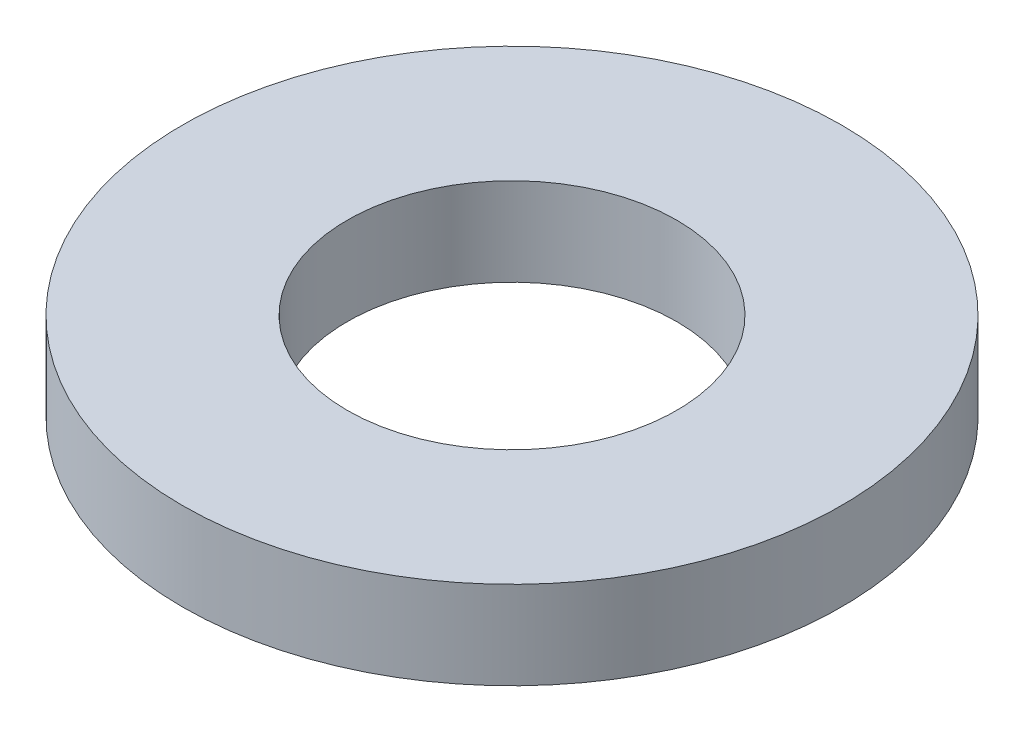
ISO-10303-21;
HEADER;
FILE_DESCRIPTION(('STEP AP214'),'2;1');
FILE_NAME('part.step','',(''),(''),'','','');
FILE_SCHEMA(('AUTOMOTIVE_DESIGN { 1 0 10303 214 1 1 1 1 }'));
ENDSEC;
DATA;
#1=APPLICATION_CONTEXT('core data for automotive mechanical design processes');
#2=APPLICATION_PROTOCOL_DEFINITION('international standard','automotive_design',2000,#1);
#3=PRODUCT_CONTEXT('',#1,'mechanical');
#4=PRODUCT('Part','Part','',(#3));
#5=PRODUCT_RELATED_PRODUCT_CATEGORY('part','',(#4));
#6=PRODUCT_DEFINITION_FORMATION('','',#4);
#7=PRODUCT_DEFINITION_CONTEXT('part definition',#1,'design');
#8=PRODUCT_DEFINITION('design','',#6,#7);
#9=PRODUCT_DEFINITION_SHAPE('','',#8);
#10=(LENGTH_UNIT() NAMED_UNIT(*) SI_UNIT(.MILLI.,.METRE.));
#11=(NAMED_UNIT(*) PLANE_ANGLE_UNIT() SI_UNIT($,.RADIAN.));
#12=(NAMED_UNIT(*) SI_UNIT($,.STERADIAN.) SOLID_ANGLE_UNIT());
#13=UNCERTAINTY_MEASURE_WITH_UNIT(LENGTH_MEASURE(1.E-05),#10,'distance_accuracy_value','');
#14=(GEOMETRIC_REPRESENTATION_CONTEXT(3) GLOBAL_UNCERTAINTY_ASSIGNED_CONTEXT((#13)) GLOBAL_UNIT_ASSIGNED_CONTEXT((#10,
#11,#12)) REPRESENTATION_CONTEXT('',''));
#15=CARTESIAN_POINT('',(0.,0.,0.));
#16=DIRECTION('',(0.,0.,1.));
#17=DIRECTION('',(1.,0.,0.));
#18=AXIS2_PLACEMENT_3D('',#15,#16,#17);
#19=CARTESIAN_POINT('',(0.,0.8,0.));
#20=DIRECTION('',(0.,1.,0.));
#21=DIRECTION('',(0.,0.,1.));
#22=AXIS2_PLACEMENT_3D('',#19,#20,#21);
#23=PLANE('',#22);
#24=CARTESIAN_POINT('',(0.,0.8,0.));
#25=DIRECTION('',(0.,1.,0.));
#26=DIRECTION('',(0.,0.,1.));
#27=AXIS2_PLACEMENT_3D('',#24,#25,#26);
#28=CIRCLE('',#27,3.);
#29=CARTESIAN_POINT('',(0.,0.8,3.));
#30=VERTEX_POINT('',#29);
#31=EDGE_CURVE('E10',#30,#30,#28,.T.);
#32=ORIENTED_EDGE('',*,*,#31,.T.);
#33=EDGE_LOOP('',(#32));
#34=FACE_BOUND('',#33,.T.);
#35=CARTESIAN_POINT('',(0.,0.8,0.));
#36=DIRECTION('',(0.,1.,0.));
#37=DIRECTION('',(0.,0.,1.));
#38=AXIS2_PLACEMENT_3D('',#35,#36,#37);
#39=CIRCLE('',#38,1.5);
#40=CARTESIAN_POINT('',(0.,0.8,1.5));
#41=VERTEX_POINT('',#40);
#42=EDGE_CURVE('E42',#41,#41,#39,.T.);
#43=ORIENTED_EDGE('',*,*,#42,.F.);
#44=EDGE_LOOP('',(#43));
#45=FACE_BOUND('',#44,.T.);
#46=ADVANCED_FACE('F31',(#34,#45),#23,.T.);
#47=CARTESIAN_POINT('',(0.,0.,0.));
#48=DIRECTION('',(0.,1.,0.));
#49=DIRECTION('',(0.,0.,1.));
#50=AXIS2_PLACEMENT_3D('',#47,#48,#49);
#51=PLANE('',#50);
#52=CARTESIAN_POINT('',(0.,0.,0.));
#53=DIRECTION('',(0.,1.,0.));
#54=DIRECTION('',(0.,0.,1.));
#55=AXIS2_PLACEMENT_3D('',#52,#53,#54);
#56=CIRCLE('',#55,3.);
#57=CARTESIAN_POINT('',(0.,0.,3.));
#58=VERTEX_POINT('',#57);
#59=EDGE_CURVE('E35',#58,#58,#56,.T.);
#60=ORIENTED_EDGE('',*,*,#59,.F.);
#61=EDGE_LOOP('',(#60));
#62=FACE_BOUND('',#61,.T.);
#63=CARTESIAN_POINT('',(0.,0.,0.));
#64=DIRECTION('',(0.,1.,0.));
#65=DIRECTION('',(0.,0.,1.));
#66=AXIS2_PLACEMENT_3D('',#63,#64,#65);
#67=CIRCLE('',#66,1.5);
#68=CARTESIAN_POINT('',(0.,0.,1.5));
#69=VERTEX_POINT('',#68);
#70=EDGE_CURVE('E44',#69,#69,#67,.T.);
#71=ORIENTED_EDGE('',*,*,#70,.T.);
#72=EDGE_LOOP('',(#71));
#73=FACE_BOUND('',#72,.T.);
#74=ADVANCED_FACE('F54',(#62,#73),#51,.F.);
#75=CARTESIAN_POINT('',(0.,0.8,0.));
#76=DIRECTION('',(0.,-1.,0.));
#77=DIRECTION('',(0.,0.,-1.));
#78=AXIS2_PLACEMENT_3D('',#75,#76,#77);
#79=CYLINDRICAL_SURFACE('',#78,3.);
#80=ORIENTED_EDGE('',*,*,#31,.F.);
#81=EDGE_LOOP('',(#80));
#82=FACE_BOUND('',#81,.T.);
#83=ORIENTED_EDGE('',*,*,#59,.T.);
#84=EDGE_LOOP('',(#83));
#85=FACE_BOUND('',#84,.T.);
#86=ADVANCED_FACE('F33',(#82,#85),#79,.T.);
#87=CARTESIAN_POINT('',(0.,0.8,0.));
#88=DIRECTION('',(0.,-1.,0.));
#89=DIRECTION('',(0.,0.,-1.));
#90=AXIS2_PLACEMENT_3D('',#87,#88,#89);
#91=CYLINDRICAL_SURFACE('',#90,1.5);
#92=ORIENTED_EDGE('',*,*,#42,.T.);
#93=EDGE_LOOP('',(#92));
#94=FACE_BOUND('',#93,.T.);
#95=ORIENTED_EDGE('',*,*,#70,.F.);
#96=EDGE_LOOP('',(#95));
#97=FACE_BOUND('',#96,.T.);
#98=ADVANCED_FACE('F50',(#94,#97),#91,.F.);
#99=CLOSED_SHELL('',(#46,#74,#86,#98));
#100=MANIFOLD_SOLID_BREP('B2',#99);
#101=ADVANCED_BREP_SHAPE_REPRESENTATION('',(#18,#100),#14);
#102=SHAPE_DEFINITION_REPRESENTATION(#9,#101);
ENDSEC;
END-ISO-10303-21;
